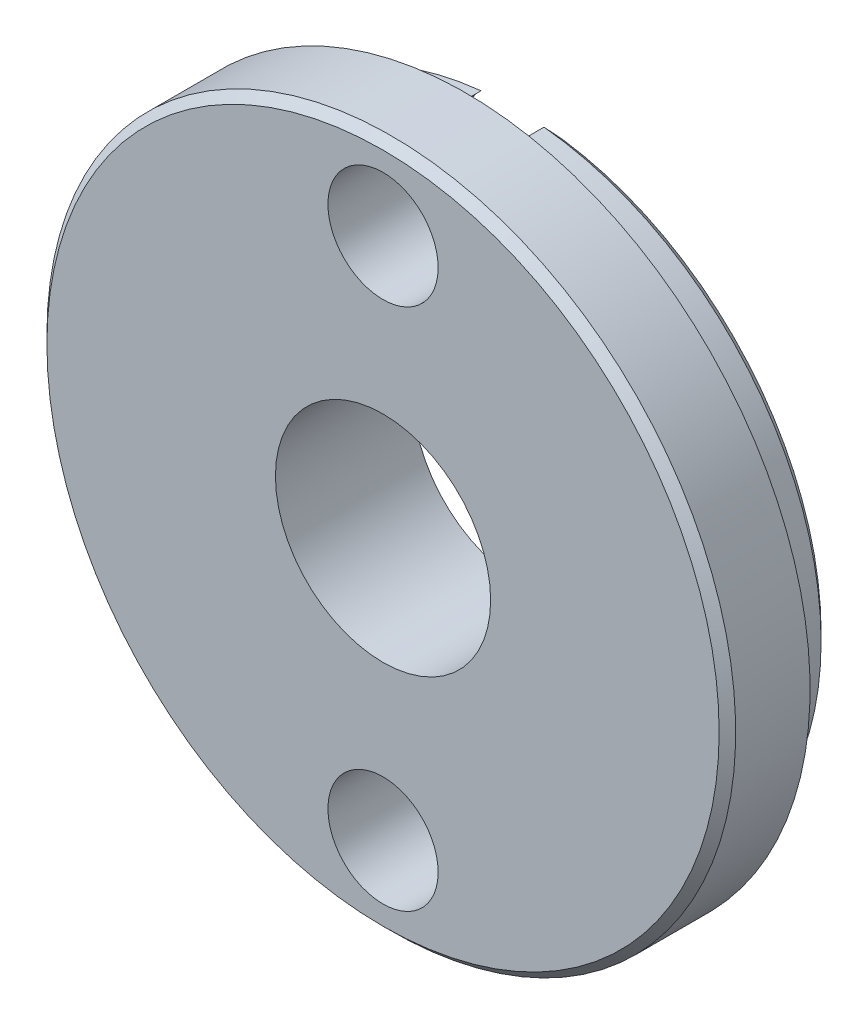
from build123d import *

# Parameters (mm, degrees)
SKETCH1_R                = 15.875
TAB_DEPTH                = 3.81
SKETCH2_R                = 14.224
BOSS_DEPTH               = 2.54
F_7_16_20_TAPPED_HOLE1_D = 9.92124
CHAMFER1_SIZE            = 0.381
SKETCH5_R                = 2.54
POTTING_HOLES_DEPTH      = 24.3313898


with BuildPart() as part:
    # Sketch1 → tab (new body)
    with BuildSketch(Plane.XY):
        with Locations(Location((0, 0, 0), (0, 0, 180))):
            Circle(SKETCH1_R)
    extrude(amount=TAB_DEPTH)

    # Sketch2 → boss (add)
    with BuildSketch(Plane(origin=(0, 0, 0), x_dir=(-1, 0, 0), z_dir=(0, 0, -1))):
        with Locations(Location((0, 0, 0), (0, 0, 180))):
            Circle(SKETCH2_R)
    extrude(amount=BOSS_DEPTH)

    # 7_16-20 Tapped Hole1 (through all)
    with Locations(Plane.XY.offset(3.81)):
        with Locations((0, 0)):
            Hole(F_7_16_20_TAPPED_HOLE1_D / 2)

    # Chamfer1
    chamfer1_edges = [part.edges().sort_by_distance(p)[0] for p in [
        (15.875, 0, 3.81),
        (-14.224, 0, -2.54),
    ]]
    chamfer(chamfer1_edges, length=CHAMFER1_SIZE)

    # Sketch5 → potting holes (cut, through all)
    with BuildSketch(Plane.XY.offset(3.81)):
        with Locations((0, 12.065)):
            Circle(SKETCH5_R)
        with Locations((0, -12.065)):
            Circle(SKETCH5_R)
    extrude(amount=-POTTING_HOLES_DEPTH, mode=Mode.SUBTRACT)


solid = part.part
